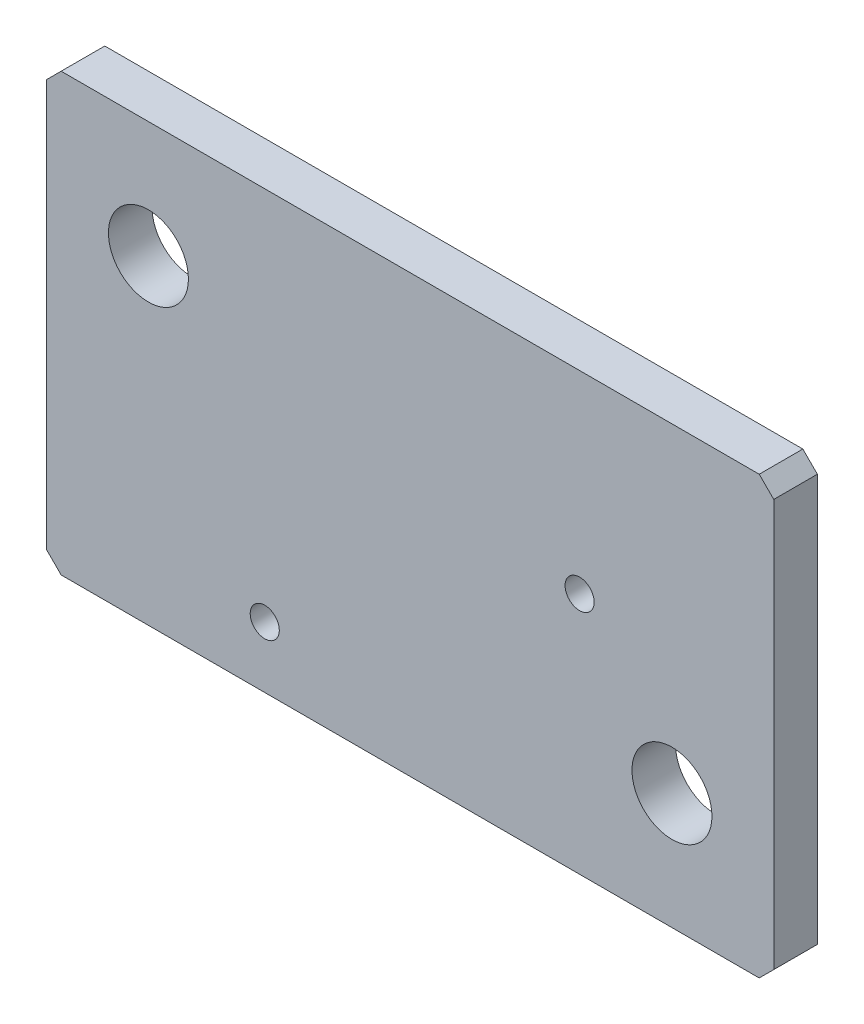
from build123d import *

# Parameters (mm, degrees)
ESQUISSE1_W      = 50
ESQUISSE1_H      = 30
ESQUISSE1_R      = 2.75
ESQUISSE1_R_2    = 1
EXTRUSION1_DEPTH = 3
CHANFREIN1_SIZE  = 1


with BuildPart() as part:
    # Esquisse1 → Extrusion1 (new body)
    with BuildSketch(Plane.XY):
        Rectangle(ESQUISSE1_W, ESQUISSE1_H)
        with Locations((-18, 7)):
            Circle(ESQUISSE1_R, mode=Mode.SUBTRACT)
        with Locations((18, -7)):
            Circle(ESQUISSE1_R, mode=Mode.SUBTRACT)
        with Locations((-10, -10.8)):
            Circle(ESQUISSE1_R_2, mode=Mode.SUBTRACT)
        with Locations((11.650635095, 1.7)):
            Circle(ESQUISSE1_R_2, mode=Mode.SUBTRACT)
    extrude(amount=EXTRUSION1_DEPTH)

    # Chanfrein1
    chanfrein1_edges = [part.edges().sort_by_distance(p)[0] for p in [
        (-25, 15, 1.5),
        (25, 15, 1.5),
        (25, -15, 1.5),
        (-25, -15, 1.5),
    ]]
    chamfer(chanfrein1_edges, length=CHANFREIN1_SIZE)


solid = part.part
